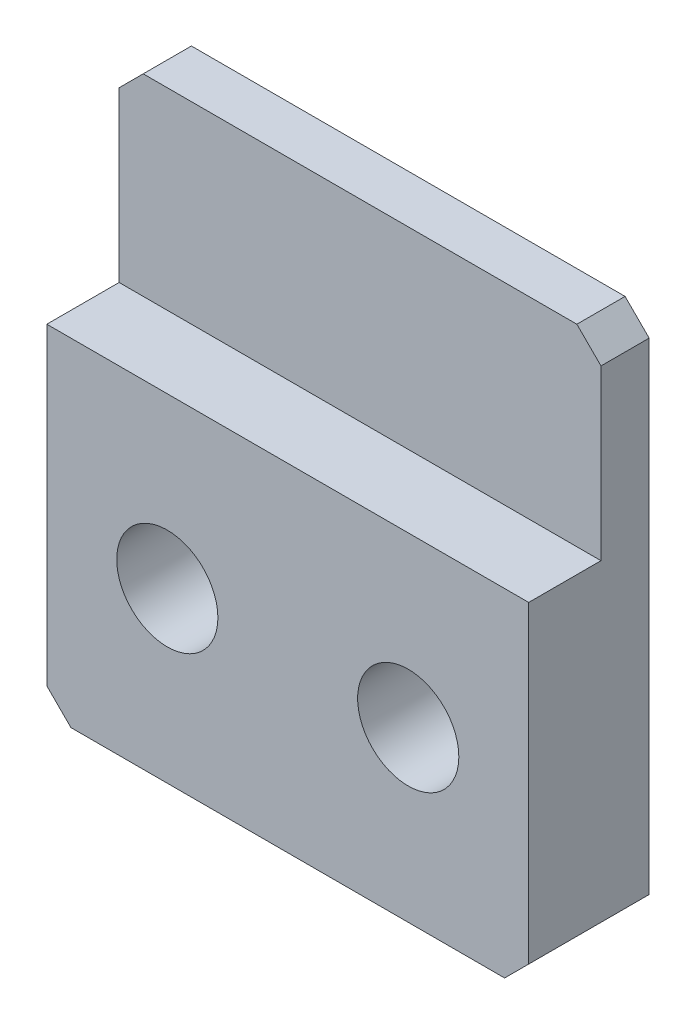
ISO-10303-21;
HEADER;
FILE_DESCRIPTION(('STEP AP214'),'2;1');
FILE_NAME('part.step','',(''),(''),'','','');
FILE_SCHEMA(('AUTOMOTIVE_DESIGN { 1 0 10303 214 1 1 1 1 }'));
ENDSEC;
DATA;
#1=APPLICATION_CONTEXT('core data for automotive mechanical design processes');
#2=APPLICATION_PROTOCOL_DEFINITION('international standard','automotive_design',2000,#1);
#3=PRODUCT_CONTEXT('',#1,'mechanical');
#4=PRODUCT('Part','Part','',(#3));
#5=PRODUCT_RELATED_PRODUCT_CATEGORY('part','',(#4));
#6=PRODUCT_DEFINITION_FORMATION('','',#4);
#7=PRODUCT_DEFINITION_CONTEXT('part definition',#1,'design');
#8=PRODUCT_DEFINITION('design','',#6,#7);
#9=PRODUCT_DEFINITION_SHAPE('','',#8);
#10=(LENGTH_UNIT() NAMED_UNIT(*) SI_UNIT(.MILLI.,.METRE.));
#11=(NAMED_UNIT(*) PLANE_ANGLE_UNIT() SI_UNIT($,.RADIAN.));
#12=(NAMED_UNIT(*) SI_UNIT($,.STERADIAN.) SOLID_ANGLE_UNIT());
#13=UNCERTAINTY_MEASURE_WITH_UNIT(LENGTH_MEASURE(1.E-05),#10,'distance_accuracy_value','');
#14=(GEOMETRIC_REPRESENTATION_CONTEXT(3) GLOBAL_UNCERTAINTY_ASSIGNED_CONTEXT((#13)) GLOBAL_UNIT_ASSIGNED_CONTEXT((#10,
#11,#12)) REPRESENTATION_CONTEXT('',''));
#15=CARTESIAN_POINT('',(0.,0.,0.));
#16=DIRECTION('',(0.,0.,1.));
#17=DIRECTION('',(1.,0.,0.));
#18=AXIS2_PLACEMENT_3D('',#15,#16,#17);
#19=CARTESIAN_POINT('',(6.,3.5,2.5));
#20=DIRECTION('',(0.,-1.,0.));
#21=DIRECTION('',(0.,0.,-1.));
#22=AXIS2_PLACEMENT_3D('',#19,#20,#21);
#23=PLANE('',#22);
#24=DIRECTION('',(-1.,0.,0.));
#25=VECTOR('',#24,1.);
#26=CARTESIAN_POINT('',(6.,3.5,1.));
#27=LINE('',#26,#25);
#28=CARTESIAN_POINT('',(5.,3.5,1.));
#29=VERTEX_POINT('',#28);
#30=CARTESIAN_POINT('',(-5.,3.5,1.));
#31=VERTEX_POINT('',#30);
#32=EDGE_CURVE('E110',#29,#31,#27,.T.);
#33=ORIENTED_EDGE('',*,*,#32,.T.);
#34=DIRECTION('',(0.,0.,-1.));
#35=VECTOR('',#34,1.);
#36=CARTESIAN_POINT('',(-5.,3.5,2.5));
#37=LINE('',#36,#35);
#38=CARTESIAN_POINT('',(-5.,3.5,2.5));
#39=VERTEX_POINT('',#38);
#40=EDGE_CURVE('E95',#39,#31,#37,.T.);
#41=ORIENTED_EDGE('',*,*,#40,.F.);
#42=DIRECTION('',(1.,0.,0.));
#43=VECTOR('',#42,1.);
#44=CARTESIAN_POINT('',(0.,3.5,2.5));
#45=LINE('',#44,#43);
#46=CARTESIAN_POINT('',(5.,3.5,2.5));
#47=VERTEX_POINT('',#46);
#48=EDGE_CURVE('E136',#47,#39,#45,.F.);
#49=ORIENTED_EDGE('',*,*,#48,.F.);
#50=DIRECTION('',(0.,0.,-1.));
#51=VECTOR('',#50,1.);
#52=CARTESIAN_POINT('',(5.,3.5,2.5));
#53=LINE('',#52,#51);
#54=EDGE_CURVE('E107',#29,#47,#53,.F.);
#55=ORIENTED_EDGE('',*,*,#54,.F.);
#56=EDGE_LOOP('',(#33,#41,#49,#55));
#57=FACE_BOUND('',#56,.T.);
#58=ADVANCED_FACE('F16',(#57),#23,.F.);
#59=CARTESIAN_POINT('',(-4.5,-3.5,0.));
#60=DIRECTION('',(-0.707106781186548,-0.707106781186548,0.));
#61=DIRECTION('',(0.707106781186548,-0.707106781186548,0.));
#62=AXIS2_PLACEMENT_3D('',#59,#60,#61);
#63=PLANE('',#62);
#64=DIRECTION('',(0.707106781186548,-0.707106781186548,0.));
#65=VECTOR('',#64,1.);
#66=CARTESIAN_POINT('',(-4.5,-3.5,0.));
#67=LINE('',#66,#65);
#68=CARTESIAN_POINT('',(-5.,-3.,0.));
#69=VERTEX_POINT('',#68);
#70=CARTESIAN_POINT('',(-4.5,-3.5,0.));
#71=VERTEX_POINT('',#70);
#72=EDGE_CURVE('E140',#69,#71,#67,.T.);
#73=ORIENTED_EDGE('',*,*,#72,.T.);
#74=DIRECTION('',(0.,0.,-1.));
#75=VECTOR('',#74,1.);
#76=CARTESIAN_POINT('',(-4.5,-3.5,0.));
#77=LINE('',#76,#75);
#78=CARTESIAN_POINT('',(-4.5,-3.5,2.5));
#79=VERTEX_POINT('',#78);
#80=EDGE_CURVE('E181',#79,#71,#77,.T.);
#81=ORIENTED_EDGE('',*,*,#80,.F.);
#82=DIRECTION('',(0.707106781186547,-0.707106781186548,0.));
#83=VECTOR('',#82,1.);
#84=CARTESIAN_POINT('',(-5.,-3.,2.5));
#85=LINE('',#84,#83);
#86=CARTESIAN_POINT('',(-5.,-3.,2.5));
#87=VERTEX_POINT('',#86);
#88=EDGE_CURVE('E138',#87,#79,#85,.T.);
#89=ORIENTED_EDGE('',*,*,#88,.F.);
#90=DIRECTION('',(0.,0.,1.));
#91=VECTOR('',#90,1.);
#92=CARTESIAN_POINT('',(-5.,-3.,0.));
#93=LINE('',#92,#91);
#94=EDGE_CURVE('E91',#69,#87,#93,.T.);
#95=ORIENTED_EDGE('',*,*,#94,.F.);
#96=EDGE_LOOP('',(#73,#81,#89,#95));
#97=FACE_BOUND('',#96,.T.);
#98=ADVANCED_FACE('F202',(#97),#63,.T.);
#99=CARTESIAN_POINT('',(0.,0.,2.5));
#100=DIRECTION('',(0.,0.,1.));
#101=DIRECTION('',(1.,0.,0.));
#102=AXIS2_PLACEMENT_3D('',#99,#100,#101);
#103=PLANE('',#102);
#104=CARTESIAN_POINT('',(2.5,0.,2.5));
#105=DIRECTION('',(0.,0.,1.));
#106=DIRECTION('',(1.,0.,0.));
#107=AXIS2_PLACEMENT_3D('',#104,#105,#106);
#108=CIRCLE('',#107,1.05);
#109=CARTESIAN_POINT('',(3.55,0.,2.5));
#110=VERTEX_POINT('',#109);
#111=EDGE_CURVE('E117',#110,#110,#108,.F.);
#112=ORIENTED_EDGE('',*,*,#111,.T.);
#113=EDGE_LOOP('',(#112));
#114=FACE_BOUND('',#113,.T.);
#115=CARTESIAN_POINT('',(-2.5,0.,2.5));
#116=DIRECTION('',(0.,0.,1.));
#117=DIRECTION('',(1.,0.,0.));
#118=AXIS2_PLACEMENT_3D('',#115,#116,#117);
#119=CIRCLE('',#118,1.05);
#120=CARTESIAN_POINT('',(-1.45,0.,2.5));
#121=VERTEX_POINT('',#120);
#122=EDGE_CURVE('E19',#121,#121,#119,.F.);
#123=ORIENTED_EDGE('',*,*,#122,.T.);
#124=EDGE_LOOP('',(#123));
#125=FACE_BOUND('',#124,.T.);
#126=DIRECTION('',(0.,1.,0.));
#127=VECTOR('',#126,1.);
#128=CARTESIAN_POINT('',(5.,-3.5,2.5));
#129=LINE('',#128,#127);
#130=CARTESIAN_POINT('',(5.,-3.,2.5));
#131=VERTEX_POINT('',#130);
#132=EDGE_CURVE('E179',#47,#131,#129,.F.);
#133=ORIENTED_EDGE('',*,*,#132,.F.);
#134=ORIENTED_EDGE('',*,*,#48,.T.);
#135=DIRECTION('',(0.,1.,0.));
#136=VECTOR('',#135,1.);
#137=CARTESIAN_POINT('',(-5.,7.5,2.5));
#138=LINE('',#137,#136);
#139=EDGE_CURVE('E103',#87,#39,#138,.T.);
#140=ORIENTED_EDGE('',*,*,#139,.F.);
#141=ORIENTED_EDGE('',*,*,#88,.T.);
#142=DIRECTION('',(1.,0.,0.));
#143=VECTOR('',#142,1.);
#144=CARTESIAN_POINT('',(-5.,-3.5,2.5));
#145=LINE('',#144,#143);
#146=CARTESIAN_POINT('',(4.5,-3.5,2.5));
#147=VERTEX_POINT('',#146);
#148=EDGE_CURVE('E184',#147,#79,#145,.F.);
#149=ORIENTED_EDGE('',*,*,#148,.F.);
#150=DIRECTION('',(0.707106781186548,0.707106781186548,0.));
#151=VECTOR('',#150,1.);
#152=CARTESIAN_POINT('',(5.,-3.,2.5));
#153=LINE('',#152,#151);
#154=EDGE_CURVE('E134',#131,#147,#153,.F.);
#155=ORIENTED_EDGE('',*,*,#154,.F.);
#156=EDGE_LOOP('',(#133,#134,#140,#141,#149,#155));
#157=FACE_BOUND('',#156,.T.);
#158=ADVANCED_FACE('F199',(#114,#125,#157),#103,.T.);
#159=CARTESIAN_POINT('',(5.,-3.,0.));
#160=DIRECTION('',(0.707106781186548,-0.707106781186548,0.));
#161=DIRECTION('',(0.707106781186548,0.707106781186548,0.));
#162=AXIS2_PLACEMENT_3D('',#159,#160,#161);
#163=PLANE('',#162);
#164=DIRECTION('',(0.707106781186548,0.707106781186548,0.));
#165=VECTOR('',#164,1.);
#166=CARTESIAN_POINT('',(5.,-3.,0.));
#167=LINE('',#166,#165);
#168=CARTESIAN_POINT('',(4.5,-3.5,0.));
#169=VERTEX_POINT('',#168);
#170=CARTESIAN_POINT('',(5.,-3.,0.));
#171=VERTEX_POINT('',#170);
#172=EDGE_CURVE('E132',#169,#171,#167,.T.);
#173=ORIENTED_EDGE('',*,*,#172,.T.);
#174=DIRECTION('',(0.,0.,-1.));
#175=VECTOR('',#174,1.);
#176=CARTESIAN_POINT('',(5.,-3.,0.));
#177=LINE('',#176,#175);
#178=EDGE_CURVE('E176',#131,#171,#177,.T.);
#179=ORIENTED_EDGE('',*,*,#178,.F.);
#180=ORIENTED_EDGE('',*,*,#154,.T.);
#181=DIRECTION('',(0.,0.,-1.));
#182=VECTOR('',#181,1.);
#183=CARTESIAN_POINT('',(4.5,-3.5,0.));
#184=LINE('',#183,#182);
#185=EDGE_CURVE('E187',#169,#147,#184,.F.);
#186=ORIENTED_EDGE('',*,*,#185,.F.);
#187=EDGE_LOOP('',(#173,#179,#180,#186));
#188=FACE_BOUND('',#187,.T.);
#189=ADVANCED_FACE('F208',(#188),#163,.T.);
#190=CARTESIAN_POINT('',(6.,3.5,1.));
#191=DIRECTION('',(0.,0.,-1.));
#192=DIRECTION('',(-1.,0.,0.));
#193=AXIS2_PLACEMENT_3D('',#190,#191,#192);
#194=PLANE('',#193);
#195=DIRECTION('',(0.,1.,0.));
#196=VECTOR('',#195,1.);
#197=CARTESIAN_POINT('',(5.,-3.5,1.));
#198=LINE('',#197,#196);
#199=CARTESIAN_POINT('',(5.,7.,1.));
#200=VERTEX_POINT('',#199);
#201=EDGE_CURVE('E174',#200,#29,#198,.F.);
#202=ORIENTED_EDGE('',*,*,#201,.F.);
#203=DIRECTION('',(-0.707106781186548,0.707106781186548,0.));
#204=VECTOR('',#203,1.);
#205=CARTESIAN_POINT('',(4.5,7.5,1.));
#206=LINE('',#205,#204);
#207=CARTESIAN_POINT('',(4.5,7.5,1.));
#208=VERTEX_POINT('',#207);
#209=EDGE_CURVE('E169',#208,#200,#206,.F.);
#210=ORIENTED_EDGE('',*,*,#209,.F.);
#211=DIRECTION('',(1.,0.,0.));
#212=VECTOR('',#211,1.);
#213=CARTESIAN_POINT('',(5.,7.5,1.));
#214=LINE('',#213,#212);
#215=CARTESIAN_POINT('',(-4.5,7.5,1.));
#216=VERTEX_POINT('',#215);
#217=EDGE_CURVE('E164',#216,#208,#214,.T.);
#218=ORIENTED_EDGE('',*,*,#217,.F.);
#219=DIRECTION('',(0.707106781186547,0.707106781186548,0.));
#220=VECTOR('',#219,1.);
#221=CARTESIAN_POINT('',(-5.,7.,1.));
#222=LINE('',#221,#220);
#223=CARTESIAN_POINT('',(-5.,7.,1.));
#224=VERTEX_POINT('',#223);
#225=EDGE_CURVE('E113',#224,#216,#222,.T.);
#226=ORIENTED_EDGE('',*,*,#225,.F.);
#227=DIRECTION('',(0.,1.,0.));
#228=VECTOR('',#227,1.);
#229=CARTESIAN_POINT('',(-5.,7.5,1.));
#230=LINE('',#229,#228);
#231=EDGE_CURVE('E100',#31,#224,#230,.T.);
#232=ORIENTED_EDGE('',*,*,#231,.F.);
#233=ORIENTED_EDGE('',*,*,#32,.F.);
#234=EDGE_LOOP('',(#202,#210,#218,#226,#232,#233));
#235=FACE_BOUND('',#234,.T.);
#236=ADVANCED_FACE('F115',(#235),#194,.F.);
#237=CARTESIAN_POINT('',(-2.5,0.,0.));
#238=DIRECTION('',(0.,0.,1.));
#239=DIRECTION('',(1.,0.,0.));
#240=AXIS2_PLACEMENT_3D('',#237,#238,#239);
#241=CYLINDRICAL_SURFACE('',#240,1.05);
#242=ORIENTED_EDGE('',*,*,#122,.F.);
#243=EDGE_LOOP('',(#242));
#244=FACE_BOUND('',#243,.T.);
#245=CARTESIAN_POINT('',(-2.5,0.,0.999999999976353));
#246=DIRECTION('',(0.,0.,-1.));
#247=DIRECTION('',(-1.,0.,0.));
#248=AXIS2_PLACEMENT_3D('',#245,#246,#247);
#249=CIRCLE('',#248,1.05000000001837);
#250=CARTESIAN_POINT('',(-3.55000000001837,0.,0.999999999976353));
#251=VERTEX_POINT('',#250);
#252=EDGE_CURVE('E127',#251,#251,#249,.T.);
#253=ORIENTED_EDGE('',*,*,#252,.T.);
#254=EDGE_LOOP('',(#253));
#255=FACE_BOUND('',#254,.T.);
#256=ADVANCED_FACE('F247',(#244,#255),#241,.F.);
#257=CARTESIAN_POINT('',(2.5,0.,0.));
#258=DIRECTION('',(0.,0.,1.));
#259=DIRECTION('',(1.,0.,0.));
#260=AXIS2_PLACEMENT_3D('',#257,#258,#259);
#261=CYLINDRICAL_SURFACE('',#260,1.05);
#262=ORIENTED_EDGE('',*,*,#111,.F.);
#263=EDGE_LOOP('',(#262));
#264=FACE_BOUND('',#263,.T.);
#265=CARTESIAN_POINT('',(2.5,0.,1.0000000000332));
#266=DIRECTION('',(0.,0.,-1.));
#267=DIRECTION('',(-1.,0.,0.));
#268=AXIS2_PLACEMENT_3D('',#265,#266,#267);
#269=CIRCLE('',#268,1.04999999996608);
#270=CARTESIAN_POINT('',(1.45000000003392,0.,1.0000000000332));
#271=VERTEX_POINT('',#270);
#272=EDGE_CURVE('E123',#271,#271,#269,.T.);
#273=ORIENTED_EDGE('',*,*,#272,.T.);
#274=EDGE_LOOP('',(#273));
#275=FACE_BOUND('',#274,.T.);
#276=ADVANCED_FACE('F245',(#264,#275),#261,.F.);
#277=CARTESIAN_POINT('',(-5.,7.5,0.));
#278=DIRECTION('',(-1.,0.,0.));
#279=DIRECTION('',(0.,0.,1.));
#280=AXIS2_PLACEMENT_3D('',#277,#278,#279);
#281=PLANE('',#280);
#282=ORIENTED_EDGE('',*,*,#139,.T.);
#283=ORIENTED_EDGE('',*,*,#40,.T.);
#284=ORIENTED_EDGE('',*,*,#231,.T.);
#285=DIRECTION('',(0.,0.,1.));
#286=VECTOR('',#285,1.);
#287=CARTESIAN_POINT('',(-5.,7.,0.));
#288=LINE('',#287,#286);
#289=CARTESIAN_POINT('',(-5.,7.,0.));
#290=VERTEX_POINT('',#289);
#291=EDGE_CURVE('E129',#290,#224,#288,.T.);
#292=ORIENTED_EDGE('',*,*,#291,.F.);
#293=DIRECTION('',(0.,1.,0.));
#294=VECTOR('',#293,1.);
#295=CARTESIAN_POINT('',(-5.,0.,0.));
#296=LINE('',#295,#294);
#297=EDGE_CURVE('E126',#290,#69,#296,.F.);
#298=ORIENTED_EDGE('',*,*,#297,.T.);
#299=ORIENTED_EDGE('',*,*,#94,.T.);
#300=EDGE_LOOP('',(#282,#283,#284,#292,#298,#299));
#301=FACE_BOUND('',#300,.T.);
#302=ADVANCED_FACE('F97',(#301),#281,.T.);
#303=CARTESIAN_POINT('',(-5.,-3.5,0.));
#304=DIRECTION('',(0.,-1.,0.));
#305=DIRECTION('',(0.,0.,-1.));
#306=AXIS2_PLACEMENT_3D('',#303,#304,#305);
#307=PLANE('',#306);
#308=ORIENTED_EDGE('',*,*,#80,.T.);
#309=DIRECTION('',(1.,0.,0.));
#310=VECTOR('',#309,1.);
#311=CARTESIAN_POINT('',(0.,-3.5,0.));
#312=LINE('',#311,#310);
#313=EDGE_CURVE('E158',#71,#169,#312,.T.);
#314=ORIENTED_EDGE('',*,*,#313,.T.);
#315=ORIENTED_EDGE('',*,*,#185,.T.);
#316=ORIENTED_EDGE('',*,*,#148,.T.);
#317=EDGE_LOOP('',(#308,#314,#315,#316));
#318=FACE_BOUND('',#317,.T.);
#319=ADVANCED_FACE('F192',(#318),#307,.T.);
#320=CARTESIAN_POINT('',(5.,-3.5,0.));
#321=DIRECTION('',(1.,0.,0.));
#322=DIRECTION('',(0.,0.,-1.));
#323=AXIS2_PLACEMENT_3D('',#320,#321,#322);
#324=PLANE('',#323);
#325=ORIENTED_EDGE('',*,*,#201,.T.);
#326=ORIENTED_EDGE('',*,*,#54,.T.);
#327=ORIENTED_EDGE('',*,*,#132,.T.);
#328=ORIENTED_EDGE('',*,*,#178,.T.);
#329=DIRECTION('',(0.,1.,0.));
#330=VECTOR('',#329,1.);
#331=CARTESIAN_POINT('',(5.,0.,0.));
#332=LINE('',#331,#330);
#333=CARTESIAN_POINT('',(5.,7.,0.));
#334=VERTEX_POINT('',#333);
#335=EDGE_CURVE('E155',#171,#334,#332,.T.);
#336=ORIENTED_EDGE('',*,*,#335,.T.);
#337=DIRECTION('',(0.,0.,1.));
#338=VECTOR('',#337,1.);
#339=CARTESIAN_POINT('',(5.,7.,0.));
#340=LINE('',#339,#338);
#341=EDGE_CURVE('E172',#200,#334,#340,.F.);
#342=ORIENTED_EDGE('',*,*,#341,.F.);
#343=EDGE_LOOP('',(#325,#326,#327,#328,#336,#342));
#344=FACE_BOUND('',#343,.T.);
#345=ADVANCED_FACE('F210',(#344),#324,.T.);
#346=CARTESIAN_POINT('',(4.5,7.5,0.));
#347=DIRECTION('',(0.707106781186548,0.707106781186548,0.));
#348=DIRECTION('',(-0.707106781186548,0.707106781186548,0.));
#349=AXIS2_PLACEMENT_3D('',#346,#347,#348);
#350=PLANE('',#349);
#351=DIRECTION('',(0.,0.,1.));
#352=VECTOR('',#351,1.);
#353=CARTESIAN_POINT('',(4.5,7.5,0.));
#354=LINE('',#353,#352);
#355=CARTESIAN_POINT('',(4.5,7.5,0.));
#356=VERTEX_POINT('',#355);
#357=EDGE_CURVE('E167',#208,#356,#354,.F.);
#358=ORIENTED_EDGE('',*,*,#357,.F.);
#359=ORIENTED_EDGE('',*,*,#209,.T.);
#360=ORIENTED_EDGE('',*,*,#341,.T.);
#361=DIRECTION('',(-0.707106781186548,0.707106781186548,0.));
#362=VECTOR('',#361,1.);
#363=CARTESIAN_POINT('',(5.,7.,0.));
#364=LINE('',#363,#362);
#365=EDGE_CURVE('E150',#334,#356,#364,.T.);
#366=ORIENTED_EDGE('',*,*,#365,.T.);
#367=EDGE_LOOP('',(#358,#359,#360,#366));
#368=FACE_BOUND('',#367,.T.);
#369=ADVANCED_FACE('F214',(#368),#350,.T.);
#370=CARTESIAN_POINT('',(5.,7.5,0.));
#371=DIRECTION('',(0.,1.,0.));
#372=DIRECTION('',(0.,0.,1.));
#373=AXIS2_PLACEMENT_3D('',#370,#371,#372);
#374=PLANE('',#373);
#375=DIRECTION('',(0.,0.,1.));
#376=VECTOR('',#375,1.);
#377=CARTESIAN_POINT('',(-4.5,7.5,0.));
#378=LINE('',#377,#376);
#379=CARTESIAN_POINT('',(-4.5,7.5,0.));
#380=VERTEX_POINT('',#379);
#381=EDGE_CURVE('E34',#216,#380,#378,.F.);
#382=ORIENTED_EDGE('',*,*,#381,.F.);
#383=ORIENTED_EDGE('',*,*,#217,.T.);
#384=ORIENTED_EDGE('',*,*,#357,.T.);
#385=DIRECTION('',(1.,0.,0.));
#386=VECTOR('',#385,1.);
#387=CARTESIAN_POINT('',(0.,7.5,0.));
#388=LINE('',#387,#386);
#389=EDGE_CURVE('E147',#356,#380,#388,.F.);
#390=ORIENTED_EDGE('',*,*,#389,.T.);
#391=EDGE_LOOP('',(#382,#383,#384,#390));
#392=FACE_BOUND('',#391,.T.);
#393=ADVANCED_FACE('F216',(#392),#374,.T.);
#394=CARTESIAN_POINT('',(-5.,7.,0.));
#395=DIRECTION('',(-0.707106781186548,0.707106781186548,0.));
#396=DIRECTION('',(-0.707106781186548,-0.707106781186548,0.));
#397=AXIS2_PLACEMENT_3D('',#394,#395,#396);
#398=PLANE('',#397);
#399=ORIENTED_EDGE('',*,*,#291,.T.);
#400=ORIENTED_EDGE('',*,*,#225,.T.);
#401=ORIENTED_EDGE('',*,*,#381,.T.);
#402=DIRECTION('',(-0.707106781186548,-0.707106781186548,0.));
#403=VECTOR('',#402,1.);
#404=CARTESIAN_POINT('',(-4.5,7.5,0.));
#405=LINE('',#404,#403);
#406=EDGE_CURVE('E144',#380,#290,#405,.T.);
#407=ORIENTED_EDGE('',*,*,#406,.T.);
#408=EDGE_LOOP('',(#399,#400,#401,#407));
#409=FACE_BOUND('',#408,.T.);
#410=ADVANCED_FACE('F217',(#409),#398,.T.);
#411=CARTESIAN_POINT('',(-2.5,0.,1.13686837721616E-10));
#412=DIRECTION('',(0.,0.,-1.));
#413=DIRECTION('',(-1.,0.,0.));
#414=AXIS2_PLACEMENT_3D('',#411,#412,#413);
#415=CONICAL_SURFACE('',#414,2.04999999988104,0.785398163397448);
#416=ORIENTED_EDGE('',*,*,#252,.F.);
#417=EDGE_LOOP('',(#416));
#418=FACE_BOUND('',#417,.T.);
#419=CARTESIAN_POINT('',(-2.5,0.,0.));
#420=DIRECTION('',(0.,0.,-1.));
#421=DIRECTION('',(-1.,0.,0.));
#422=AXIS2_PLACEMENT_3D('',#419,#420,#421);
#423=CIRCLE('',#422,2.04999999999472);
#424=CARTESIAN_POINT('',(-4.54999999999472,0.,0.));
#425=VERTEX_POINT('',#424);
#426=EDGE_CURVE('E25',#425,#425,#423,.T.);
#427=ORIENTED_EDGE('',*,*,#426,.T.);
#428=EDGE_LOOP('',(#427));
#429=FACE_BOUND('',#428,.T.);
#430=ADVANCED_FACE('F219',(#418,#429),#415,.F.);
#431=CARTESIAN_POINT('',(2.5,0.,5.6843418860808E-11));
#432=DIRECTION('',(0.,0.,-1.));
#433=DIRECTION('',(-1.,0.,0.));
#434=AXIS2_PLACEMENT_3D('',#431,#432,#433);
#435=CONICAL_SURFACE('',#434,2.04999999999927,0.78539816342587);
#436=ORIENTED_EDGE('',*,*,#272,.F.);
#437=EDGE_LOOP('',(#436));
#438=FACE_BOUND('',#437,.T.);
#439=CARTESIAN_POINT('',(2.5,0.,5.91172076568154E-11));
#440=DIRECTION('',(0.,0.,-1.));
#441=DIRECTION('',(-1.,0.,0.));
#442=AXIS2_PLACEMENT_3D('',#439,#440,#441);
#443=CIRCLE('',#442,2.049999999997);
#444=CARTESIAN_POINT('',(0.450000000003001,0.,5.91172076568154E-11));
#445=VERTEX_POINT('',#444);
#446=EDGE_CURVE('E11',#445,#445,#443,.T.);
#447=ORIENTED_EDGE('',*,*,#446,.T.);
#448=EDGE_LOOP('',(#447));
#449=FACE_BOUND('',#448,.T.);
#450=ADVANCED_FACE('F226',(#438,#449),#435,.F.);
#451=CARTESIAN_POINT('',(0.,0.,0.));
#452=DIRECTION('',(0.,0.,1.));
#453=DIRECTION('',(1.,0.,0.));
#454=AXIS2_PLACEMENT_3D('',#451,#452,#453);
#455=PLANE('',#454);
#456=ORIENTED_EDGE('',*,*,#446,.F.);
#457=EDGE_LOOP('',(#456));
#458=FACE_BOUND('',#457,.T.);
#459=ORIENTED_EDGE('',*,*,#426,.F.);
#460=EDGE_LOOP('',(#459));
#461=FACE_BOUND('',#460,.T.);
#462=ORIENTED_EDGE('',*,*,#389,.F.);
#463=ORIENTED_EDGE('',*,*,#365,.F.);
#464=ORIENTED_EDGE('',*,*,#335,.F.);
#465=ORIENTED_EDGE('',*,*,#172,.F.);
#466=ORIENTED_EDGE('',*,*,#313,.F.);
#467=ORIENTED_EDGE('',*,*,#72,.F.);
#468=ORIENTED_EDGE('',*,*,#297,.F.);
#469=ORIENTED_EDGE('',*,*,#406,.F.);
#470=EDGE_LOOP('',(#462,#463,#464,#465,#466,#467,#468,#469));
#471=FACE_BOUND('',#470,.T.);
#472=ADVANCED_FACE('F205',(#458,#461,#471),#455,.F.);
#473=CLOSED_SHELL('',(#58,#98,#158,#189,#236,#256,#276,#302,#319,#345,#369,#393,#410,#430,#450,#472));
#474=MANIFOLD_SOLID_BREP('B1',#473);
#475=ADVANCED_BREP_SHAPE_REPRESENTATION('',(#18,#474),#14);
#476=SHAPE_DEFINITION_REPRESENTATION(#9,#475);
ENDSEC;
END-ISO-10303-21;
